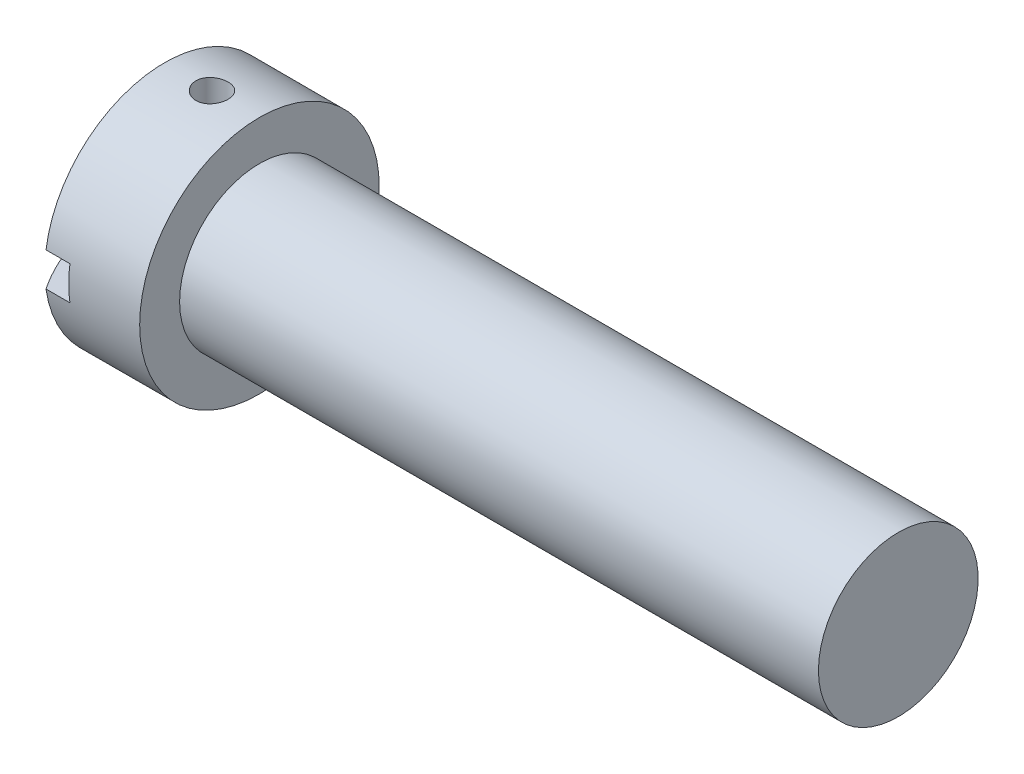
from build123d import *

# Parameters (mm, degrees)
SKETCH2_W          = 19.05
SKETCH2_H          = 2.6924
SLOT_DEPTH         = 4.826
SKETCH6_R          = 1.27889
CUT_EXTRUDE1_DEPTH = 635.762


with BuildPart() as part:
    # BodySke → Base-Revolve (revolve)
    with BuildSketch(Plane.XY, mode=Mode.PRIVATE) as base_revolve_sk:
        with BuildLine():
            Line((10.4648, 6.35), (10.4648, 9.525))
            Line((10.4648, 9.525), (2.921, 9.525))
            ThreePointArc((2.921, 9.525), (0.746656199, 4.981412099), (0, 0))
            Line((0, 0), (61.2648, 0))
            Line((61.2648, 0), (61.2648, 6.35))
            Line((61.2648, 6.35), (10.4648, 6.35))
        make_face()
    revolve(base_revolve_sk.sketch.rotate(Axis((-25.4, 0, 0), (1, 0, 0)), 90), axis=Axis((-25.4, 0, 0), (1, 0, 0)))

    # Sketch2 → Slot (cut)
    with BuildSketch(Plane(origin=(0, 0, 0), x_dir=(0, 0, -1), z_dir=(1, 0, 0))):
        Rectangle(SKETCH2_W, SKETCH2_H)
    extrude(amount=SLOT_DEPTH, mode=Mode.SUBTRACT)

    # Sketch6 → Cut-Extrude1 (cut, symmetric)
    with BuildSketch(Plane(origin=(0, 0, 0), x_dir=(1, 0, 0), z_dir=(0, 1, 0))):
        with Locations(Location((6.6929, 0, 0), (0, 0, 270))):
            Circle(SKETCH6_R)
    extrude(amount=CUT_EXTRUDE1_DEPTH, both=True, mode=Mode.SUBTRACT)


solid = part.part
